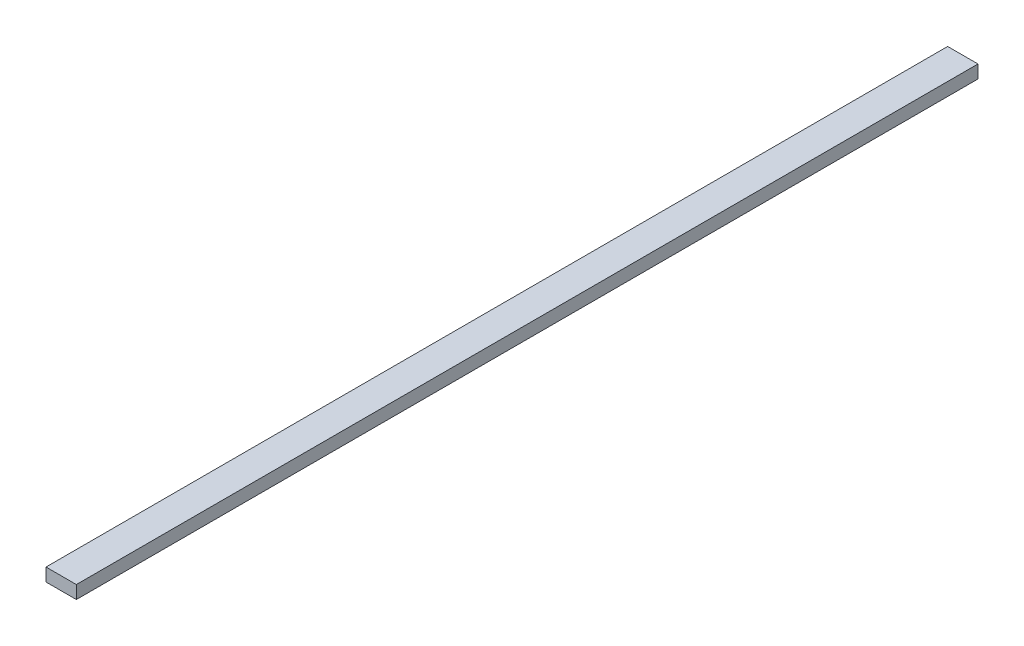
ISO-10303-21;
HEADER;
FILE_DESCRIPTION(('STEP AP214'),'2;1');
FILE_NAME('part.step','',(''),(''),'','','');
FILE_SCHEMA(('AUTOMOTIVE_DESIGN { 1 0 10303 214 1 1 1 1 }'));
ENDSEC;
DATA;
#1=APPLICATION_CONTEXT('core data for automotive mechanical design processes');
#2=APPLICATION_PROTOCOL_DEFINITION('international standard','automotive_design',2000,#1);
#3=PRODUCT_CONTEXT('',#1,'mechanical');
#4=PRODUCT('Part','Part','',(#3));
#5=PRODUCT_RELATED_PRODUCT_CATEGORY('part','',(#4));
#6=PRODUCT_DEFINITION_FORMATION('','',#4);
#7=PRODUCT_DEFINITION_CONTEXT('part definition',#1,'design');
#8=PRODUCT_DEFINITION('design','',#6,#7);
#9=PRODUCT_DEFINITION_SHAPE('','',#8);
#10=(LENGTH_UNIT() NAMED_UNIT(*) SI_UNIT(.MILLI.,.METRE.));
#11=(NAMED_UNIT(*) PLANE_ANGLE_UNIT() SI_UNIT($,.RADIAN.));
#12=(NAMED_UNIT(*) SI_UNIT($,.STERADIAN.) SOLID_ANGLE_UNIT());
#13=UNCERTAINTY_MEASURE_WITH_UNIT(LENGTH_MEASURE(1.E-05),#10,'distance_accuracy_value','');
#14=(GEOMETRIC_REPRESENTATION_CONTEXT(3) GLOBAL_UNCERTAINTY_ASSIGNED_CONTEXT((#13)) GLOBAL_UNIT_ASSIGNED_CONTEXT((#10,
#11,#12)) REPRESENTATION_CONTEXT('',''));
#15=CARTESIAN_POINT('',(0.,0.,0.));
#16=DIRECTION('',(0.,0.,1.));
#17=DIRECTION('',(1.,0.,0.));
#18=AXIS2_PLACEMENT_3D('',#15,#16,#17);
#19=CARTESIAN_POINT('',(-44.45,19.05,1320.8));
#20=DIRECTION('',(1.,0.,0.));
#21=DIRECTION('',(0.,0.,-1.));
#22=AXIS2_PLACEMENT_3D('',#19,#20,#21);
#23=PLANE('',#22);
#24=DIRECTION('',(0.,-1.,0.));
#25=VECTOR('',#24,1.);
#26=CARTESIAN_POINT('',(-44.45,19.05,-1320.8));
#27=LINE('',#26,#25);
#28=CARTESIAN_POINT('',(-44.45,19.05,-1320.8));
#29=VERTEX_POINT('',#28);
#30=CARTESIAN_POINT('',(-44.45,-19.05,-1320.8));
#31=VERTEX_POINT('',#30);
#32=EDGE_CURVE('E96',#29,#31,#27,.T.);
#33=ORIENTED_EDGE('',*,*,#32,.T.);
#34=DIRECTION('',(0.,0.,-1.));
#35=VECTOR('',#34,1.);
#36=CARTESIAN_POINT('',(-44.45,-19.05,1320.8));
#37=LINE('',#36,#35);
#38=CARTESIAN_POINT('',(-44.45,-19.05,1320.8));
#39=VERTEX_POINT('',#38);
#40=EDGE_CURVE('E11',#39,#31,#37,.T.);
#41=ORIENTED_EDGE('',*,*,#40,.F.);
#42=DIRECTION('',(0.,-1.,0.));
#43=VECTOR('',#42,1.);
#44=CARTESIAN_POINT('',(-44.45,19.05,1320.8));
#45=LINE('',#44,#43);
#46=CARTESIAN_POINT('',(-44.45,19.05,1320.8));
#47=VERTEX_POINT('',#46);
#48=EDGE_CURVE('E84',#47,#39,#45,.T.);
#49=ORIENTED_EDGE('',*,*,#48,.F.);
#50=DIRECTION('',(0.,0.,-1.));
#51=VECTOR('',#50,1.);
#52=CARTESIAN_POINT('',(-44.45,19.05,1320.8));
#53=LINE('',#52,#51);
#54=EDGE_CURVE('E92',#47,#29,#53,.T.);
#55=ORIENTED_EDGE('',*,*,#54,.T.);
#56=EDGE_LOOP('',(#33,#41,#49,#55));
#57=FACE_BOUND('',#56,.T.);
#58=ADVANCED_FACE('F33',(#57),#23,.F.);
#59=CARTESIAN_POINT('',(-44.45,-19.05,1320.8));
#60=DIRECTION('',(0.,1.,0.));
#61=DIRECTION('',(-1.,0.,0.));
#62=AXIS2_PLACEMENT_3D('',#59,#60,#61);
#63=PLANE('',#62);
#64=DIRECTION('',(1.,0.,0.));
#65=VECTOR('',#64,1.);
#66=CARTESIAN_POINT('',(-44.45,-19.05,-1320.8));
#67=LINE('',#66,#65);
#68=CARTESIAN_POINT('',(44.45,-19.05,-1320.8));
#69=VERTEX_POINT('',#68);
#70=EDGE_CURVE('E88',#31,#69,#67,.T.);
#71=ORIENTED_EDGE('',*,*,#70,.T.);
#72=DIRECTION('',(0.,0.,-1.));
#73=VECTOR('',#72,1.);
#74=CARTESIAN_POINT('',(44.45,-19.05,1320.8));
#75=LINE('',#74,#73);
#76=CARTESIAN_POINT('',(44.45,-19.05,1320.8));
#77=VERTEX_POINT('',#76);
#78=EDGE_CURVE('E41',#77,#69,#75,.T.);
#79=ORIENTED_EDGE('',*,*,#78,.F.);
#80=DIRECTION('',(1.,0.,0.));
#81=VECTOR('',#80,1.);
#82=CARTESIAN_POINT('',(-44.45,-19.05,1320.8));
#83=LINE('',#82,#81);
#84=EDGE_CURVE('E79',#39,#77,#83,.T.);
#85=ORIENTED_EDGE('',*,*,#84,.F.);
#86=ORIENTED_EDGE('',*,*,#40,.T.);
#87=EDGE_LOOP('',(#71,#79,#85,#86));
#88=FACE_BOUND('',#87,.T.);
#89=ADVANCED_FACE('F87',(#88),#63,.F.);
#90=CARTESIAN_POINT('',(44.45,19.05,1320.8));
#91=DIRECTION('',(-1.,0.,0.));
#92=DIRECTION('',(0.,0.,1.));
#93=AXIS2_PLACEMENT_3D('',#90,#91,#92);
#94=PLANE('',#93);
#95=DIRECTION('',(0.,1.,0.));
#96=VECTOR('',#95,1.);
#97=CARTESIAN_POINT('',(44.45,19.05,-1320.8));
#98=LINE('',#97,#96);
#99=CARTESIAN_POINT('',(44.45,19.05,-1320.8));
#100=VERTEX_POINT('',#99);
#101=EDGE_CURVE('E66',#69,#100,#98,.T.);
#102=ORIENTED_EDGE('',*,*,#101,.T.);
#103=DIRECTION('',(0.,0.,-1.));
#104=VECTOR('',#103,1.);
#105=CARTESIAN_POINT('',(44.45,19.05,1320.8));
#106=LINE('',#105,#104);
#107=CARTESIAN_POINT('',(44.45,19.05,1320.8));
#108=VERTEX_POINT('',#107);
#109=EDGE_CURVE('E89',#108,#100,#106,.T.);
#110=ORIENTED_EDGE('',*,*,#109,.F.);
#111=DIRECTION('',(0.,1.,0.));
#112=VECTOR('',#111,1.);
#113=CARTESIAN_POINT('',(44.45,19.05,1320.8));
#114=LINE('',#113,#112);
#115=EDGE_CURVE('E82',#77,#108,#114,.T.);
#116=ORIENTED_EDGE('',*,*,#115,.F.);
#117=ORIENTED_EDGE('',*,*,#78,.T.);
#118=EDGE_LOOP('',(#102,#110,#116,#117));
#119=FACE_BOUND('',#118,.T.);
#120=ADVANCED_FACE('F90',(#119),#94,.F.);
#121=CARTESIAN_POINT('',(-44.45,19.05,1320.8));
#122=DIRECTION('',(0.,-1.,0.));
#123=DIRECTION('',(1.,0.,0.));
#124=AXIS2_PLACEMENT_3D('',#121,#122,#123);
#125=PLANE('',#124);
#126=DIRECTION('',(-1.,0.,0.));
#127=VECTOR('',#126,1.);
#128=CARTESIAN_POINT('',(-44.45,19.05,-1320.8));
#129=LINE('',#128,#127);
#130=EDGE_CURVE('E72',#100,#29,#129,.T.);
#131=ORIENTED_EDGE('',*,*,#130,.T.);
#132=ORIENTED_EDGE('',*,*,#54,.F.);
#133=DIRECTION('',(-1.,0.,0.));
#134=VECTOR('',#133,1.);
#135=CARTESIAN_POINT('',(-44.45,19.05,1320.8));
#136=LINE('',#135,#134);
#137=EDGE_CURVE('E49',#108,#47,#136,.T.);
#138=ORIENTED_EDGE('',*,*,#137,.F.);
#139=ORIENTED_EDGE('',*,*,#109,.T.);
#140=EDGE_LOOP('',(#131,#132,#138,#139));
#141=FACE_BOUND('',#140,.T.);
#142=ADVANCED_FACE('F103',(#141),#125,.F.);
#143=CARTESIAN_POINT('',(0.,0.,1320.8));
#144=DIRECTION('',(0.,0.,1.));
#145=DIRECTION('',(1.,0.,0.));
#146=AXIS2_PLACEMENT_3D('',#143,#144,#145);
#147=PLANE('',#146);
#148=ORIENTED_EDGE('',*,*,#48,.T.);
#149=ORIENTED_EDGE('',*,*,#84,.T.);
#150=ORIENTED_EDGE('',*,*,#115,.T.);
#151=ORIENTED_EDGE('',*,*,#137,.T.);
#152=EDGE_LOOP('',(#148,#149,#150,#151));
#153=FACE_BOUND('',#152,.T.);
#154=ADVANCED_FACE('F80',(#153),#147,.T.);
#155=CARTESIAN_POINT('',(0.,0.,-1320.8));
#156=DIRECTION('',(0.,0.,1.));
#157=DIRECTION('',(1.,0.,0.));
#158=AXIS2_PLACEMENT_3D('',#155,#156,#157);
#159=PLANE('',#158);
#160=ORIENTED_EDGE('',*,*,#32,.F.);
#161=ORIENTED_EDGE('',*,*,#130,.F.);
#162=ORIENTED_EDGE('',*,*,#101,.F.);
#163=ORIENTED_EDGE('',*,*,#70,.F.);
#164=EDGE_LOOP('',(#160,#161,#162,#163));
#165=FACE_BOUND('',#164,.T.);
#166=ADVANCED_FACE('F106',(#165),#159,.F.);
#167=CLOSED_SHELL('',(#58,#89,#120,#142,#154,#166));
#168=MANIFOLD_SOLID_BREP('B2',#167);
#169=ADVANCED_BREP_SHAPE_REPRESENTATION('',(#18,#168),#14);
#170=SHAPE_DEFINITION_REPRESENTATION(#9,#169);
ENDSEC;
END-ISO-10303-21;
